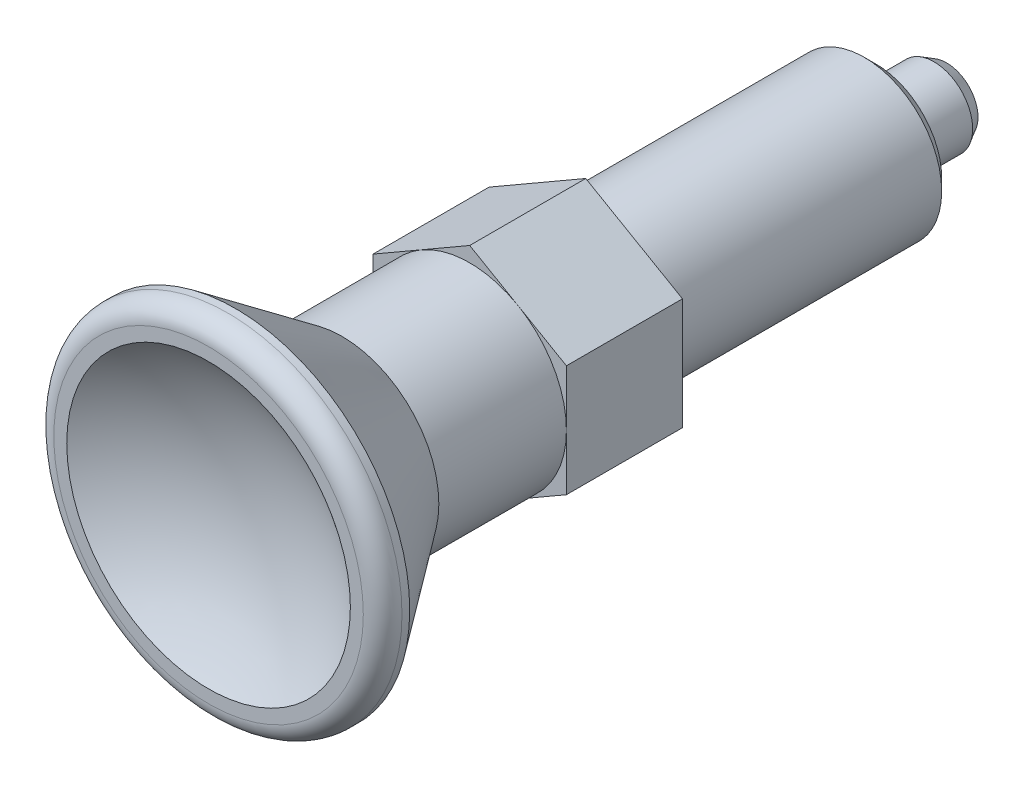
ISO-10303-21;
HEADER;
FILE_DESCRIPTION(('STEP AP214'),'2;1');
FILE_NAME('part.step','',(''),(''),'','','');
FILE_SCHEMA(('AUTOMOTIVE_DESIGN { 1 0 10303 214 1 1 1 1 }'));
ENDSEC;
DATA;
#1=APPLICATION_CONTEXT('core data for automotive mechanical design processes');
#2=APPLICATION_PROTOCOL_DEFINITION('international standard','automotive_design',2000,#1);
#3=PRODUCT_CONTEXT('',#1,'mechanical');
#4=PRODUCT('Part','Part','',(#3));
#5=PRODUCT_RELATED_PRODUCT_CATEGORY('part','',(#4));
#6=PRODUCT_DEFINITION_FORMATION('','',#4);
#7=PRODUCT_DEFINITION_CONTEXT('part definition',#1,'design');
#8=PRODUCT_DEFINITION('design','',#6,#7);
#9=PRODUCT_DEFINITION_SHAPE('','',#8);
#10=(LENGTH_UNIT() NAMED_UNIT(*) SI_UNIT(.MILLI.,.METRE.));
#11=(NAMED_UNIT(*) PLANE_ANGLE_UNIT() SI_UNIT($,.RADIAN.));
#12=(NAMED_UNIT(*) SI_UNIT($,.STERADIAN.) SOLID_ANGLE_UNIT());
#13=UNCERTAINTY_MEASURE_WITH_UNIT(LENGTH_MEASURE(1.E-05),#10,'distance_accuracy_value','');
#14=(GEOMETRIC_REPRESENTATION_CONTEXT(3) GLOBAL_UNCERTAINTY_ASSIGNED_CONTEXT((#13)) GLOBAL_UNIT_ASSIGNED_CONTEXT((#10,
#11,#12)) REPRESENTATION_CONTEXT('',''));
#15=CARTESIAN_POINT('',(0.,0.,0.));
#16=DIRECTION('',(0.,0.,1.));
#17=DIRECTION('',(1.,0.,0.));
#18=AXIS2_PLACEMENT_3D('',#15,#16,#17);
#19=CARTESIAN_POINT('',(0.,0.,-15.));
#20=DIRECTION('',(0.,0.,1.));
#21=DIRECTION('',(1.,0.,0.));
#22=AXIS2_PLACEMENT_3D('',#19,#20,#21);
#23=SPHERICAL_SURFACE('',#22,4.);
#24=CARTESIAN_POINT('',(0.,0.,-18.656953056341));
#25=DIRECTION('',(0.,0.,1.));
#26=DIRECTION('',(1.,0.,0.));
#27=AXIS2_PLACEMENT_3D('',#24,#25,#26);
#28=CIRCLE('',#27,1.62070797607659);
#29=CARTESIAN_POINT('',(1.62070797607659,0.,-18.656953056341));
#30=VERTEX_POINT('',#29);
#31=EDGE_CURVE('E138',#30,#30,#28,.T.);
#32=ORIENTED_EDGE('',*,*,#31,.F.);
#33=EDGE_LOOP('',(#32));
#34=FACE_BOUND('',#33,.T.);
#35=ADVANCED_FACE('F14',(#34),#23,.T.);
#36=CARTESIAN_POINT('',(4.,0.,0.));
#37=DIRECTION('',(0.,0.,-1.));
#38=DIRECTION('',(-1.,0.,0.));
#39=AXIS2_PLACEMENT_3D('',#36,#37,#38);
#40=PLANE('',#39);
#41=CARTESIAN_POINT('',(0.,0.,0.));
#42=DIRECTION('',(0.,0.,1.));
#43=DIRECTION('',(1.,0.,0.));
#44=AXIS2_PLACEMENT_3D('',#41,#42,#43);
#45=CIRCLE('',#44,4.);
#46=CARTESIAN_POINT('',(4.,0.,0.));
#47=VERTEX_POINT('',#46);
#48=EDGE_CURVE('E163',#47,#47,#45,.T.);
#49=ORIENTED_EDGE('',*,*,#48,.T.);
#50=EDGE_LOOP('',(#49));
#51=FACE_BOUND('',#50,.T.);
#52=DIRECTION('',(0.866025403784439,-0.5,0.));
#53=VECTOR('',#52,1.);
#54=CARTESIAN_POINT('',(0.,5.77350269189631,0.));
#55=LINE('',#54,#53);
#56=CARTESIAN_POINT('',(0.,5.77350269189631,0.));
#57=VERTEX_POINT('',#56);
#58=CARTESIAN_POINT('',(5.,2.88675134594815,0.));
#59=VERTEX_POINT('',#58);
#60=EDGE_CURVE('E113',#57,#59,#55,.T.);
#61=ORIENTED_EDGE('',*,*,#60,.T.);
#62=DIRECTION('',(0.,-1.,0.));
#63=VECTOR('',#62,1.);
#64=CARTESIAN_POINT('',(5.,2.88675134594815,0.));
#65=LINE('',#64,#63);
#66=CARTESIAN_POINT('',(5.,-2.88675134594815,0.));
#67=VERTEX_POINT('',#66);
#68=EDGE_CURVE('E87',#59,#67,#65,.T.);
#69=ORIENTED_EDGE('',*,*,#68,.T.);
#70=DIRECTION('',(-0.866025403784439,-0.5,0.));
#71=VECTOR('',#70,1.);
#72=CARTESIAN_POINT('',(5.,-2.88675134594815,0.));
#73=LINE('',#72,#71);
#74=CARTESIAN_POINT('',(0.,-5.77350269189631,0.));
#75=VERTEX_POINT('',#74);
#76=EDGE_CURVE('E80',#67,#75,#73,.T.);
#77=ORIENTED_EDGE('',*,*,#76,.T.);
#78=DIRECTION('',(-0.866025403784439,0.5,0.));
#79=VECTOR('',#78,1.);
#80=CARTESIAN_POINT('',(0.,-5.77350269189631,0.));
#81=LINE('',#80,#79);
#82=CARTESIAN_POINT('',(-5.,-2.88675134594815,0.));
#83=VERTEX_POINT('',#82);
#84=EDGE_CURVE('E85',#75,#83,#81,.T.);
#85=ORIENTED_EDGE('',*,*,#84,.T.);
#86=DIRECTION('',(0.,1.,0.));
#87=VECTOR('',#86,1.);
#88=CARTESIAN_POINT('',(-5.,-2.88675134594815,0.));
#89=LINE('',#88,#87);
#90=CARTESIAN_POINT('',(-5.,2.88675134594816,0.));
#91=VERTEX_POINT('',#90);
#92=EDGE_CURVE('E107',#83,#91,#89,.T.);
#93=ORIENTED_EDGE('',*,*,#92,.T.);
#94=DIRECTION('',(0.866025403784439,0.5,0.));
#95=VECTOR('',#94,1.);
#96=CARTESIAN_POINT('',(-5.,2.88675134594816,0.));
#97=LINE('',#96,#95);
#98=EDGE_CURVE('E109',#91,#57,#97,.T.);
#99=ORIENTED_EDGE('',*,*,#98,.T.);
#100=EDGE_LOOP('',(#61,#69,#77,#85,#93,#99));
#101=FACE_BOUND('',#100,.T.);
#102=ADVANCED_FACE('F83',(#51,#101),#40,.T.);
#103=CARTESIAN_POINT('',(0.,0.,20.9596108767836));
#104=DIRECTION('',(0.,0.,1.));
#105=DIRECTION('',(1.,0.,0.));
#106=AXIS2_PLACEMENT_3D('',#103,#104,#105);
#107=CYLINDRICAL_SURFACE('',#106,4.);
#108=CARTESIAN_POINT('',(0.,0.,-14.4));
#109=DIRECTION('',(0.,0.,1.));
#110=DIRECTION('',(1.,0.,0.));
#111=AXIS2_PLACEMENT_3D('',#108,#109,#110);
#112=CIRCLE('',#111,4.);
#113=CARTESIAN_POINT('',(4.,0.,-14.4));
#114=VERTEX_POINT('',#113);
#115=EDGE_CURVE('E160',#114,#114,#112,.T.);
#116=ORIENTED_EDGE('',*,*,#115,.T.);
#117=EDGE_LOOP('',(#116));
#118=FACE_BOUND('',#117,.T.);
#119=ORIENTED_EDGE('',*,*,#48,.F.);
#120=EDGE_LOOP('',(#119));
#121=FACE_BOUND('',#120,.T.);
#122=ADVANCED_FACE('F233',(#118,#121),#107,.T.);
#123=CARTESIAN_POINT('',(0.,0.,-14.4));
#124=DIRECTION('',(0.,0.,1.));
#125=DIRECTION('',(1.,0.,0.));
#126=AXIS2_PLACEMENT_3D('',#123,#124,#125);
#127=CONICAL_SURFACE('',#126,4.,0.785398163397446);
#128=CARTESIAN_POINT('',(0.,0.,-15.));
#129=DIRECTION('',(0.,0.,1.));
#130=DIRECTION('',(1.,0.,0.));
#131=AXIS2_PLACEMENT_3D('',#128,#129,#130);
#132=CIRCLE('',#131,3.4);
#133=CARTESIAN_POINT('',(3.4,0.,-15.));
#134=VERTEX_POINT('',#133);
#135=EDGE_CURVE('E157',#134,#134,#132,.T.);
#136=ORIENTED_EDGE('',*,*,#135,.T.);
#137=EDGE_LOOP('',(#136));
#138=FACE_BOUND('',#137,.T.);
#139=ORIENTED_EDGE('',*,*,#115,.F.);
#140=EDGE_LOOP('',(#139));
#141=FACE_BOUND('',#140,.T.);
#142=ADVANCED_FACE('F254',(#138,#141),#127,.T.);
#143=CARTESIAN_POINT('',(3.4,0.,-15.));
#144=DIRECTION('',(0.,0.,-1.));
#145=DIRECTION('',(-1.,0.,0.));
#146=AXIS2_PLACEMENT_3D('',#143,#144,#145);
#147=PLANE('',#146);
#148=CARTESIAN_POINT('',(0.,0.,-15.));
#149=DIRECTION('',(0.,0.,1.));
#150=DIRECTION('',(1.,0.,0.));
#151=AXIS2_PLACEMENT_3D('',#148,#149,#150);
#152=CIRCLE('',#151,2.);
#153=CARTESIAN_POINT('',(2.,0.,-15.));
#154=VERTEX_POINT('',#153);
#155=EDGE_CURVE('E154',#154,#154,#152,.T.);
#156=ORIENTED_EDGE('',*,*,#155,.T.);
#157=EDGE_LOOP('',(#156));
#158=FACE_BOUND('',#157,.T.);
#159=ORIENTED_EDGE('',*,*,#135,.F.);
#160=EDGE_LOOP('',(#159));
#161=FACE_BOUND('',#160,.T.);
#162=ADVANCED_FACE('F248',(#158,#161),#147,.T.);
#163=CARTESIAN_POINT('',(0.,0.,20.9596108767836));
#164=DIRECTION('',(0.,0.,1.));
#165=DIRECTION('',(1.,0.,0.));
#166=AXIS2_PLACEMENT_3D('',#163,#164,#165);
#167=CYLINDRICAL_SURFACE('',#166,2.);
#168=CARTESIAN_POINT('',(0.,0.,-18.));
#169=DIRECTION('',(0.,0.,1.));
#170=DIRECTION('',(1.,0.,0.));
#171=AXIS2_PLACEMENT_3D('',#168,#169,#170);
#172=CIRCLE('',#171,2.);
#173=CARTESIAN_POINT('',(2.,0.,-18.));
#174=VERTEX_POINT('',#173);
#175=EDGE_CURVE('E151',#174,#174,#172,.T.);
#176=ORIENTED_EDGE('',*,*,#175,.T.);
#177=EDGE_LOOP('',(#176));
#178=FACE_BOUND('',#177,.T.);
#179=ORIENTED_EDGE('',*,*,#155,.F.);
#180=EDGE_LOOP('',(#179));
#181=FACE_BOUND('',#180,.T.);
#182=ADVANCED_FACE('F242',(#178,#181),#167,.T.);
#183=CARTESIAN_POINT('',(0.,0.,-18.));
#184=DIRECTION('',(0.,0.,1.));
#185=DIRECTION('',(1.,0.,0.));
#186=AXIS2_PLACEMENT_3D('',#183,#184,#185);
#187=CONICAL_SURFACE('',#186,2.,0.523598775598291);
#188=ORIENTED_EDGE('',*,*,#31,.T.);
#189=EDGE_LOOP('',(#188));
#190=FACE_BOUND('',#189,.T.);
#191=ORIENTED_EDGE('',*,*,#175,.F.);
#192=EDGE_LOOP('',(#191));
#193=FACE_BOUND('',#192,.T.);
#194=ADVANCED_FACE('F238',(#190,#193),#187,.T.);
#195=CARTESIAN_POINT('',(10.,0.,6.));
#196=DIRECTION('',(0.,0.,1.));
#197=DIRECTION('',(1.,0.,0.));
#198=AXIS2_PLACEMENT_3D('',#195,#196,#197);
#199=PLANE('',#198);
#200=DIRECTION('',(0.,-1.,0.));
#201=VECTOR('',#200,1.);
#202=CARTESIAN_POINT('',(5.,2.88675134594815,6.));
#203=LINE('',#202,#201);
#204=CARTESIAN_POINT('',(5.,0.,6.));
#205=VERTEX_POINT('',#204);
#206=CARTESIAN_POINT('',(5.,-2.88675134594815,6.));
#207=VERTEX_POINT('',#206);
#208=EDGE_CURVE('E133',#205,#207,#203,.T.);
#209=ORIENTED_EDGE('',*,*,#208,.F.);
#210=CARTESIAN_POINT('',(0.,0.,6.));
#211=DIRECTION('',(0.,0.,1.));
#212=DIRECTION('',(1.,0.,0.));
#213=AXIS2_PLACEMENT_3D('',#210,#211,#212);
#214=CIRCLE('',#213,5.);
#215=CARTESIAN_POINT('',(2.5,-4.33012701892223,6.));
#216=VERTEX_POINT('',#215);
#217=EDGE_CURVE('E9',#205,#216,#214,.F.);
#218=ORIENTED_EDGE('',*,*,#217,.T.);
#219=DIRECTION('',(-0.866025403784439,-0.5,0.));
#220=VECTOR('',#219,1.);
#221=CARTESIAN_POINT('',(5.,-2.88675134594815,6.));
#222=LINE('',#221,#220);
#223=EDGE_CURVE('E116',#207,#216,#222,.T.);
#224=ORIENTED_EDGE('',*,*,#223,.F.);
#225=EDGE_LOOP('',(#209,#218,#224));
#226=FACE_BOUND('',#225,.T.);
#227=ADVANCED_FACE('F241',(#226),#199,.T.);
#228=CARTESIAN_POINT('',(0.,-5.77350269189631,6.));
#229=VERTEX_POINT('',#228);
#230=EDGE_CURVE('E97',#216,#229,#222,.T.);
#231=ORIENTED_EDGE('',*,*,#230,.F.);
#232=CARTESIAN_POINT('',(-2.5,-4.33012701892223,6.));
#233=VERTEX_POINT('',#232);
#234=EDGE_CURVE('E22',#216,#233,#214,.F.);
#235=ORIENTED_EDGE('',*,*,#234,.T.);
#236=DIRECTION('',(-0.866025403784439,0.5,0.));
#237=VECTOR('',#236,1.);
#238=CARTESIAN_POINT('',(0.,-5.77350269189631,6.));
#239=LINE('',#238,#237);
#240=EDGE_CURVE('E119',#229,#233,#239,.T.);
#241=ORIENTED_EDGE('',*,*,#240,.F.);
#242=EDGE_LOOP('',(#231,#235,#241));
#243=FACE_BOUND('',#242,.T.);
#244=ADVANCED_FACE('F200',(#243),#199,.T.);
#245=CARTESIAN_POINT('',(-5.,-2.88675134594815,6.));
#246=VERTEX_POINT('',#245);
#247=EDGE_CURVE('E118',#233,#246,#239,.T.);
#248=ORIENTED_EDGE('',*,*,#247,.F.);
#249=CARTESIAN_POINT('',(-5.,0.,6.));
#250=VERTEX_POINT('',#249);
#251=EDGE_CURVE('E32',#233,#250,#214,.F.);
#252=ORIENTED_EDGE('',*,*,#251,.T.);
#253=DIRECTION('',(0.,1.,0.));
#254=VECTOR('',#253,1.);
#255=CARTESIAN_POINT('',(-5.,-2.88675134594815,6.));
#256=LINE('',#255,#254);
#257=EDGE_CURVE('E122',#246,#250,#256,.T.);
#258=ORIENTED_EDGE('',*,*,#257,.F.);
#259=EDGE_LOOP('',(#248,#252,#258));
#260=FACE_BOUND('',#259,.T.);
#261=ADVANCED_FACE('F201',(#260),#199,.T.);
#262=CARTESIAN_POINT('',(-5.,2.88675134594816,6.));
#263=VERTEX_POINT('',#262);
#264=EDGE_CURVE('E121',#250,#263,#256,.T.);
#265=ORIENTED_EDGE('',*,*,#264,.F.);
#266=CARTESIAN_POINT('',(-2.5,4.33012701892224,6.));
#267=VERTEX_POINT('',#266);
#268=EDGE_CURVE('E188',#250,#267,#214,.F.);
#269=ORIENTED_EDGE('',*,*,#268,.T.);
#270=DIRECTION('',(0.866025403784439,0.5,0.));
#271=VECTOR('',#270,1.);
#272=CARTESIAN_POINT('',(-5.,2.88675134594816,6.));
#273=LINE('',#272,#271);
#274=EDGE_CURVE('E126',#263,#267,#273,.T.);
#275=ORIENTED_EDGE('',*,*,#274,.F.);
#276=EDGE_LOOP('',(#265,#269,#275));
#277=FACE_BOUND('',#276,.T.);
#278=ADVANCED_FACE('F217',(#277),#199,.T.);
#279=CARTESIAN_POINT('',(0.,5.77350269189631,6.));
#280=VERTEX_POINT('',#279);
#281=EDGE_CURVE('E125',#267,#280,#273,.T.);
#282=ORIENTED_EDGE('',*,*,#281,.F.);
#283=CARTESIAN_POINT('',(2.5,4.33012701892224,6.));
#284=VERTEX_POINT('',#283);
#285=EDGE_CURVE('E182',#267,#284,#214,.F.);
#286=ORIENTED_EDGE('',*,*,#285,.T.);
#287=DIRECTION('',(0.866025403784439,-0.5,0.));
#288=VECTOR('',#287,1.);
#289=CARTESIAN_POINT('',(0.,5.77350269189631,6.));
#290=LINE('',#289,#288);
#291=EDGE_CURVE('E130',#280,#284,#290,.T.);
#292=ORIENTED_EDGE('',*,*,#291,.F.);
#293=EDGE_LOOP('',(#282,#286,#292));
#294=FACE_BOUND('',#293,.T.);
#295=ADVANCED_FACE('F216',(#294),#199,.T.);
#296=CARTESIAN_POINT('',(5.,-2.88675134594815,6.));
#297=DIRECTION('',(0.5,-0.866025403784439,0.));
#298=DIRECTION('',(0.866025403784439,0.5,0.));
#299=AXIS2_PLACEMENT_3D('',#296,#297,#298);
#300=PLANE('',#299);
#301=DIRECTION('',(0.,0.,-1.));
#302=VECTOR('',#301,1.);
#303=CARTESIAN_POINT('',(0.,-5.77350269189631,6.));
#304=LINE('',#303,#302);
#305=EDGE_CURVE('E93',#229,#75,#304,.T.);
#306=ORIENTED_EDGE('',*,*,#305,.T.);
#307=ORIENTED_EDGE('',*,*,#76,.F.);
#308=DIRECTION('',(0.,0.,-1.));
#309=VECTOR('',#308,1.);
#310=CARTESIAN_POINT('',(5.,-2.88675134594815,6.));
#311=LINE('',#310,#309);
#312=EDGE_CURVE('E136',#207,#67,#311,.T.);
#313=ORIENTED_EDGE('',*,*,#312,.F.);
#314=ORIENTED_EDGE('',*,*,#223,.T.);
#315=ORIENTED_EDGE('',*,*,#230,.T.);
#316=EDGE_LOOP('',(#306,#307,#313,#314,#315));
#317=FACE_BOUND('',#316,.T.);
#318=ADVANCED_FACE('F94',(#317),#300,.T.);
#319=CARTESIAN_POINT('',(5.,2.88675134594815,6.));
#320=DIRECTION('',(1.,0.,0.));
#321=DIRECTION('',(0.,0.,-1.));
#322=AXIS2_PLACEMENT_3D('',#319,#320,#321);
#323=PLANE('',#322);
#324=ORIENTED_EDGE('',*,*,#68,.F.);
#325=DIRECTION('',(0.,0.,-1.));
#326=VECTOR('',#325,1.);
#327=CARTESIAN_POINT('',(5.,2.88675134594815,6.));
#328=LINE('',#327,#326);
#329=CARTESIAN_POINT('',(5.,2.88675134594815,6.));
#330=VERTEX_POINT('',#329);
#331=EDGE_CURVE('E139',#330,#59,#328,.T.);
#332=ORIENTED_EDGE('',*,*,#331,.F.);
#333=EDGE_CURVE('E102',#330,#205,#203,.T.);
#334=ORIENTED_EDGE('',*,*,#333,.T.);
#335=ORIENTED_EDGE('',*,*,#208,.T.);
#336=ORIENTED_EDGE('',*,*,#312,.T.);
#337=EDGE_LOOP('',(#324,#332,#334,#335,#336));
#338=FACE_BOUND('',#337,.T.);
#339=ADVANCED_FACE('F214',(#338),#323,.T.);
#340=CARTESIAN_POINT('',(0.,5.77350269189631,6.));
#341=DIRECTION('',(0.5,0.866025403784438,0.));
#342=DIRECTION('',(-0.866025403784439,0.5,0.));
#343=AXIS2_PLACEMENT_3D('',#340,#341,#342);
#344=PLANE('',#343);
#345=ORIENTED_EDGE('',*,*,#331,.T.);
#346=ORIENTED_EDGE('',*,*,#60,.F.);
#347=DIRECTION('',(0.,0.,-1.));
#348=VECTOR('',#347,1.);
#349=CARTESIAN_POINT('',(0.,5.77350269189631,6.));
#350=LINE('',#349,#348);
#351=EDGE_CURVE('E142',#280,#57,#350,.T.);
#352=ORIENTED_EDGE('',*,*,#351,.F.);
#353=ORIENTED_EDGE('',*,*,#291,.T.);
#354=EDGE_CURVE('E129',#284,#330,#290,.T.);
#355=ORIENTED_EDGE('',*,*,#354,.T.);
#356=EDGE_LOOP('',(#345,#346,#352,#353,#355));
#357=FACE_BOUND('',#356,.T.);
#358=ADVANCED_FACE('F211',(#357),#344,.T.);
#359=CARTESIAN_POINT('',(-5.,2.88675134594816,6.));
#360=DIRECTION('',(-0.5,0.866025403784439,0.));
#361=DIRECTION('',(-0.866025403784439,-0.5,0.));
#362=AXIS2_PLACEMENT_3D('',#359,#360,#361);
#363=PLANE('',#362);
#364=ORIENTED_EDGE('',*,*,#351,.T.);
#365=ORIENTED_EDGE('',*,*,#98,.F.);
#366=DIRECTION('',(0.,0.,-1.));
#367=VECTOR('',#366,1.);
#368=CARTESIAN_POINT('',(-5.,2.88675134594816,6.));
#369=LINE('',#368,#367);
#370=EDGE_CURVE('E145',#263,#91,#369,.T.);
#371=ORIENTED_EDGE('',*,*,#370,.F.);
#372=ORIENTED_EDGE('',*,*,#274,.T.);
#373=ORIENTED_EDGE('',*,*,#281,.T.);
#374=EDGE_LOOP('',(#364,#365,#371,#372,#373));
#375=FACE_BOUND('',#374,.T.);
#376=ADVANCED_FACE('F209',(#375),#363,.T.);
#377=CARTESIAN_POINT('',(-5.,-2.88675134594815,6.));
#378=DIRECTION('',(-1.,0.,0.));
#379=DIRECTION('',(0.,-1.,0.));
#380=AXIS2_PLACEMENT_3D('',#377,#378,#379);
#381=PLANE('',#380);
#382=ORIENTED_EDGE('',*,*,#370,.T.);
#383=ORIENTED_EDGE('',*,*,#92,.F.);
#384=DIRECTION('',(0.,0.,-1.));
#385=VECTOR('',#384,1.);
#386=CARTESIAN_POINT('',(-5.,-2.88675134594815,6.));
#387=LINE('',#386,#385);
#388=EDGE_CURVE('E101',#246,#83,#387,.T.);
#389=ORIENTED_EDGE('',*,*,#388,.F.);
#390=ORIENTED_EDGE('',*,*,#257,.T.);
#391=ORIENTED_EDGE('',*,*,#264,.T.);
#392=EDGE_LOOP('',(#382,#383,#389,#390,#391));
#393=FACE_BOUND('',#392,.T.);
#394=ADVANCED_FACE('F203',(#393),#381,.T.);
#395=CARTESIAN_POINT('',(0.,-5.77350269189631,6.));
#396=DIRECTION('',(-0.5,-0.866025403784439,0.));
#397=DIRECTION('',(0.866025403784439,-0.5,0.));
#398=AXIS2_PLACEMENT_3D('',#395,#396,#397);
#399=PLANE('',#398);
#400=ORIENTED_EDGE('',*,*,#388,.T.);
#401=ORIENTED_EDGE('',*,*,#84,.F.);
#402=ORIENTED_EDGE('',*,*,#305,.F.);
#403=ORIENTED_EDGE('',*,*,#240,.T.);
#404=ORIENTED_EDGE('',*,*,#247,.T.);
#405=EDGE_LOOP('',(#400,#401,#402,#403,#404));
#406=FACE_BOUND('',#405,.T.);
#407=ADVANCED_FACE('F104',(#406),#399,.T.);
#408=ORIENTED_EDGE('',*,*,#354,.F.);
#409=EDGE_CURVE('E17',#284,#205,#214,.F.);
#410=ORIENTED_EDGE('',*,*,#409,.T.);
#411=ORIENTED_EDGE('',*,*,#333,.F.);
#412=EDGE_LOOP('',(#408,#410,#411));
#413=FACE_BOUND('',#412,.T.);
#414=ADVANCED_FACE('F215',(#413),#199,.T.);
#415=CARTESIAN_POINT('',(0.,0.,29.));
#416=DIRECTION('',(0.,0.,1.));
#417=DIRECTION('',(1.,0.,0.));
#418=AXIS2_PLACEMENT_3D('',#415,#416,#417);
#419=SPHERICAL_SURFACE('',#418,12.);
#420=CARTESIAN_POINT('',(0.,0.,19.5));
#421=DIRECTION('',(0.,0.,1.));
#422=DIRECTION('',(1.,0.,0.));
#423=AXIS2_PLACEMENT_3D('',#420,#421,#422);
#424=CIRCLE('',#423,7.33143914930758);
#425=CARTESIAN_POINT('',(7.33143914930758,0.,19.5));
#426=VERTEX_POINT('',#425);
#427=EDGE_CURVE('E177',#426,#426,#424,.T.);
#428=ORIENTED_EDGE('',*,*,#427,.T.);
#429=EDGE_LOOP('',(#428));
#430=FACE_BOUND('',#429,.T.);
#431=ADVANCED_FACE('F288',(#430),#419,.F.);
#432=CARTESIAN_POINT('',(8.,0.,19.5));
#433=DIRECTION('',(0.,0.,1.));
#434=DIRECTION('',(1.,0.,0.));
#435=AXIS2_PLACEMENT_3D('',#432,#433,#434);
#436=PLANE('',#435);
#437=CARTESIAN_POINT('',(0.,0.,19.5));
#438=DIRECTION('',(0.,0.,1.));
#439=DIRECTION('',(1.,0.,0.));
#440=AXIS2_PLACEMENT_3D('',#437,#438,#439);
#441=CIRCLE('',#440,8.);
#442=CARTESIAN_POINT('',(8.,0.,19.5));
#443=VERTEX_POINT('',#442);
#444=EDGE_CURVE('E175',#443,#443,#441,.T.);
#445=ORIENTED_EDGE('',*,*,#444,.T.);
#446=EDGE_LOOP('',(#445));
#447=FACE_BOUND('',#446,.T.);
#448=ORIENTED_EDGE('',*,*,#427,.F.);
#449=EDGE_LOOP('',(#448));
#450=FACE_BOUND('',#449,.T.);
#451=ADVANCED_FACE('F285',(#447,#450),#436,.T.);
#452=CARTESIAN_POINT('',(0.,0.,18.5));
#453=DIRECTION('',(0.,0.,1.));
#454=DIRECTION('',(1.,0.,0.));
#455=AXIS2_PLACEMENT_3D('',#452,#453,#454);
#456=TOROIDAL_SURFACE('',#455,8.,1.);
#457=CARTESIAN_POINT('',(0.,0.,18.5));
#458=DIRECTION('',(0.,0.,1.));
#459=DIRECTION('',(1.,0.,0.));
#460=AXIS2_PLACEMENT_3D('',#457,#458,#459);
#461=CIRCLE('',#460,9.);
#462=CARTESIAN_POINT('',(9.,0.,18.5));
#463=VERTEX_POINT('',#462);
#464=EDGE_CURVE('E172',#463,#463,#461,.T.);
#465=ORIENTED_EDGE('',*,*,#464,.T.);
#466=EDGE_LOOP('',(#465));
#467=FACE_BOUND('',#466,.T.);
#468=ORIENTED_EDGE('',*,*,#444,.F.);
#469=EDGE_LOOP('',(#468));
#470=FACE_BOUND('',#469,.T.);
#471=ADVANCED_FACE('F281',(#467,#470),#456,.T.);
#472=CARTESIAN_POINT('',(0.,0.,20.9596108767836));
#473=DIRECTION('',(0.,0.,1.));
#474=DIRECTION('',(1.,0.,0.));
#475=AXIS2_PLACEMENT_3D('',#472,#473,#474);
#476=CYLINDRICAL_SURFACE('',#475,9.);
#477=CARTESIAN_POINT('',(0.,0.,18.1));
#478=DIRECTION('',(0.,0.,1.));
#479=DIRECTION('',(1.,0.,0.));
#480=AXIS2_PLACEMENT_3D('',#477,#478,#479);
#481=CIRCLE('',#480,9.);
#482=CARTESIAN_POINT('',(9.,0.,18.1));
#483=VERTEX_POINT('',#482);
#484=EDGE_CURVE('E169',#483,#483,#481,.T.);
#485=ORIENTED_EDGE('',*,*,#484,.T.);
#486=EDGE_LOOP('',(#485));
#487=FACE_BOUND('',#486,.T.);
#488=ORIENTED_EDGE('',*,*,#464,.F.);
#489=EDGE_LOOP('',(#488));
#490=FACE_BOUND('',#489,.T.);
#491=ADVANCED_FACE('F277',(#487,#490),#476,.T.);
#492=CARTESIAN_POINT('',(0.,0.,18.1));
#493=DIRECTION('',(0.,0.,1.));
#494=DIRECTION('',(1.,0.,0.));
#495=AXIS2_PLACEMENT_3D('',#492,#493,#494);
#496=CONICAL_SURFACE('',#495,9.,0.628318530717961);
#497=CARTESIAN_POINT('',(0.,0.,12.5944723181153));
#498=DIRECTION('',(0.,0.,1.));
#499=DIRECTION('',(1.,0.,0.));
#500=AXIS2_PLACEMENT_3D('',#497,#498,#499);
#501=CIRCLE('',#500,5.);
#502=CARTESIAN_POINT('',(5.,0.,12.5944723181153));
#503=VERTEX_POINT('',#502);
#504=EDGE_CURVE('E166',#503,#503,#501,.T.);
#505=ORIENTED_EDGE('',*,*,#504,.T.);
#506=EDGE_LOOP('',(#505));
#507=FACE_BOUND('',#506,.T.);
#508=ORIENTED_EDGE('',*,*,#484,.F.);
#509=EDGE_LOOP('',(#508));
#510=FACE_BOUND('',#509,.T.);
#511=ADVANCED_FACE('F274',(#507,#510),#496,.T.);
#512=CARTESIAN_POINT('',(0.,0.,20.9596108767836));
#513=DIRECTION('',(0.,0.,1.));
#514=DIRECTION('',(1.,0.,0.));
#515=AXIS2_PLACEMENT_3D('',#512,#513,#514);
#516=CYLINDRICAL_SURFACE('',#515,5.);
#517=ORIENTED_EDGE('',*,*,#217,.F.);
#518=ORIENTED_EDGE('',*,*,#409,.F.);
#519=ORIENTED_EDGE('',*,*,#285,.F.);
#520=ORIENTED_EDGE('',*,*,#268,.F.);
#521=ORIENTED_EDGE('',*,*,#251,.F.);
#522=ORIENTED_EDGE('',*,*,#234,.F.);
#523=EDGE_LOOP('',(#517,#518,#519,#520,#521,#522));
#524=FACE_BOUND('',#523,.T.);
#525=ORIENTED_EDGE('',*,*,#504,.F.);
#526=EDGE_LOOP('',(#525));
#527=FACE_BOUND('',#526,.T.);
#528=ADVANCED_FACE('F271',(#524,#527),#516,.T.);
#529=CLOSED_SHELL('',(#35,#102,#122,#142,#162,#182,#194,#227,#244,#261,#278,#295,#318,#339,#358,
#376,#394,#407,#414,#431,#451,#471,#491,#511,#528));
#530=MANIFOLD_SOLID_BREP('B1',#529);
#531=ADVANCED_BREP_SHAPE_REPRESENTATION('',(#18,#530),#14);
#532=SHAPE_DEFINITION_REPRESENTATION(#9,#531);
ENDSEC;
END-ISO-10303-21;
